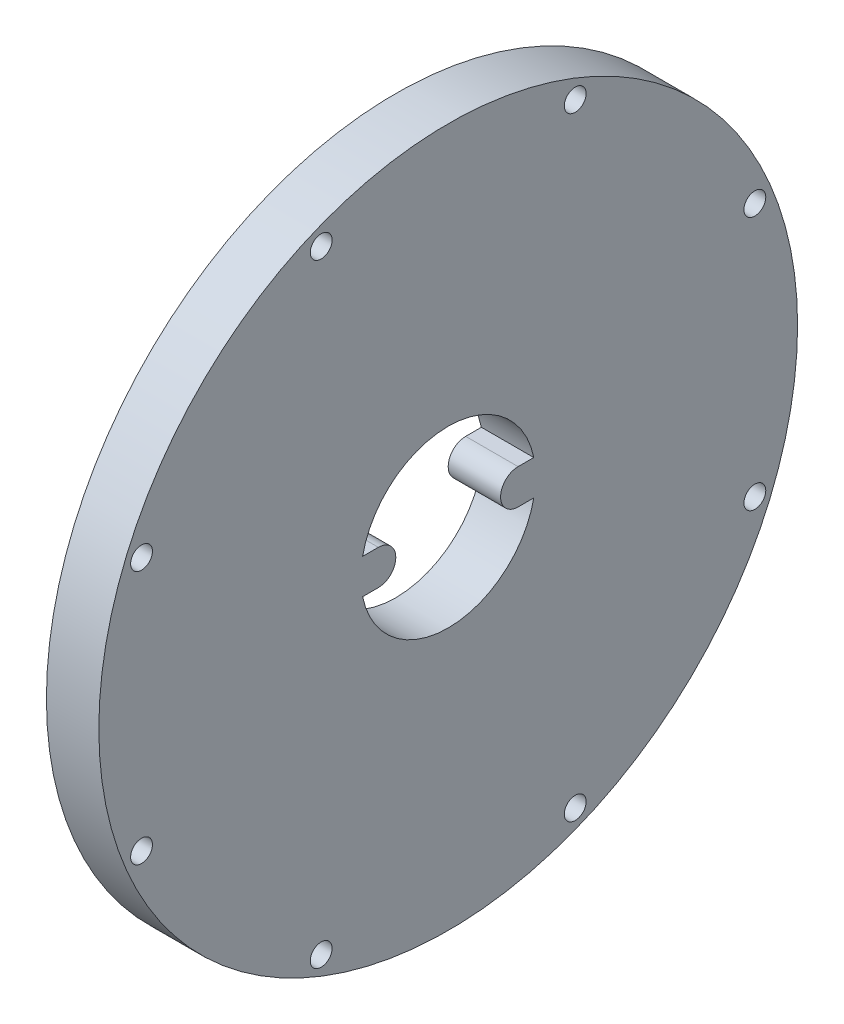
from build123d import *

# Parameters (mm, degrees)
ESQUISSE1_R             = 80
ESQUISSE1_R_2           = 1.5
BOSS_EXTRU_1_DEPTH      = 12
ESQUISSE2_R             = 2.5
ENL_V_MAT_EXTRU_1_DEPTH = 5


with BuildPart() as part:
    # Esquisse1 → Boss.-Extru.1 (new body)
    with BuildSketch(Plane(origin=(0, 0, 0), x_dir=(0, 0, -1), z_dir=(1, 0, 0))):
        Circle(ESQUISSE1_R)
        with Locations((29.08394086, 70.214844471)):
            Circle(ESQUISSE1_R_2, mode=Mode.SUBTRACT)
        with Locations((70.214844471, 29.08394086)):
            Circle(ESQUISSE1_R_2, mode=Mode.SUBTRACT)
        with Locations((70.214844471, -29.08394086)):
            Circle(ESQUISSE1_R_2, mode=Mode.SUBTRACT)
        with Locations((29.08394086, -70.214844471)):
            Circle(ESQUISSE1_R_2, mode=Mode.SUBTRACT)
        with Locations((-29.08394086, -70.214844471)):
            Circle(ESQUISSE1_R_2, mode=Mode.SUBTRACT)
        with Locations((-70.214844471, -29.08394086)):
            Circle(ESQUISSE1_R_2, mode=Mode.SUBTRACT)
        with Locations((-70.214844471, 29.08394086)):
            Circle(ESQUISSE1_R_2, mode=Mode.SUBTRACT)
        with Locations((-29.08394086, 70.214844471)):
            Circle(ESQUISSE1_R_2, mode=Mode.SUBTRACT)
        with BuildLine():
            Line((-16, 4), (-19.595917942, 4))
            ThreePointArc((-19.595917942, 4), (0, 20), (19.595917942, 4))
            Line((19.595917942, 4), (16, 4))
            ThreePointArc((16, 4), (12, 0), (16, -4))
            Line((16, -4), (19.595917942, -4))
            ThreePointArc((19.595917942, -4), (0, -20), (-19.595917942, -4))
            Line((-19.595917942, -4), (-16, -4))
            ThreePointArc((-16, -4), (-12, 0), (-16, 4))
        make_face(mode=Mode.SUBTRACT)
    extrude(amount=BOSS_EXTRU_1_DEPTH)

    # Esquisse2 → Enl_v. mat.-Extru.1 (cut)
    with BuildSketch(Plane(origin=(12, 0, 0), x_dir=(0, 0, -1), z_dir=(1, 0, 0))):
        with Locations((29.08394086, 70.214844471)):
            Circle(ESQUISSE2_R)
        with Locations((70.214844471, 29.08394086)):
            Circle(ESQUISSE2_R)
        with Locations((70.214844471, -29.08394086)):
            Circle(ESQUISSE2_R)
        with Locations((29.08394086, -70.214844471)):
            Circle(ESQUISSE2_R)
        with Locations((-29.08394086, -70.214844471)):
            Circle(ESQUISSE2_R)
        with Locations((-70.214844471, -29.08394086)):
            Circle(ESQUISSE2_R)
        with Locations((-70.214844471, 29.08394086)):
            Circle(ESQUISSE2_R)
        with Locations((-29.08394086, 70.214844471)):
            Circle(ESQUISSE2_R)
    extrude(amount=-ENL_V_MAT_EXTRU_1_DEPTH, mode=Mode.SUBTRACT)


solid = part.part
